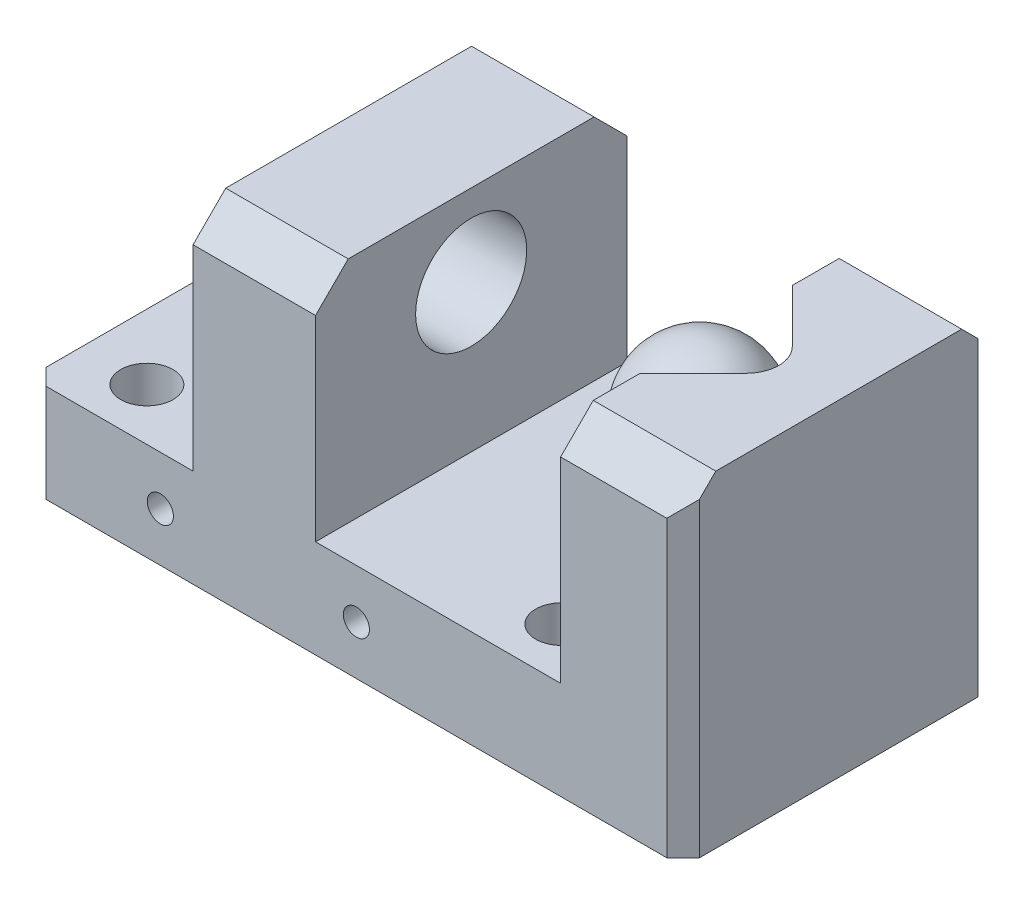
from build123d import *

# Parameters (mm, degrees)
BOSS_EXTRU_1_DEPTH              = 9.525
DIAM_TRE_DU_PER_AGE_3_2_3_2_1_D = 3.2
ENL_V_MAT_EXTRU_1_DEPTH         = 10
ENL_V_MAT_EXTRU_1_DEPTH_BACK    = 5
CHANFREIN1_SIZE                 = 2
CHANFREIN2_SIZE                 = 1
CHANFREIN3_SIZE                 = 1
TROU_TARAUD_M21_AT_2_COUNT      = 2
TROU_TARAUD_M21_AT_2_PITCH      = 12


with BuildPart() as part:
    # Esquisse1 → Boss.-Extru.1 (new, symmetric)
    with BuildSketch(Plane.XY):
        Polygon((0, 6), (0, 0), (40, 0), (40, 20), (32.5, 20), (32.5, 6), (17.5, 6), (17.5, 20), (10, 20), (10, 6), align=None)
    extrude(amount=BOSS_EXTRU_1_DEPTH, both=True)

    # Diam_tre du per_age _3.2 _3.2_1 (through all)
    with Locations(Plane(origin=(0, 0, 0), x_dir=(-1, 0, 0), z_dir=(0, -1, 0))):
        with Locations((-4, 6.35), (-29.4, 6.35), (-4, -6.35), (-29.4, -6.35)):
            Hole(DIAM_TRE_DU_PER_AGE_3_2_3_2_1_D / 2)

    # Esquisse5 → Enl_v. mat.-Extru.1 (cut, two sides: drawn at the far end of the back side and taken through both)
    with BuildSketch(Plane(origin=(0, 15, 0), x_dir=(1, 0, 0), z_dir=(0, 1, 0)).offset(-ENL_V_MAT_EXTRU_1_DEPTH_BACK)):
        with BuildLine():
            Line((32.5, 4.656854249), (32.5, -4.656854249))
            Line((32.5, -4.656854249), (35.742640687, -1.414213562))
            ThreePointArc((35.742640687, -1.414213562), (36.328427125, 0), (35.742640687, 1.414213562))
            Line((35.742640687, 1.414213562), (32.5, 4.656854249))
        make_face()
    extrude(amount=ENL_V_MAT_EXTRU_1_DEPTH + ENL_V_MAT_EXTRU_1_DEPTH_BACK, mode=Mode.SUBTRACT)

    # Esquisse7 → Trou taraud_ M81 (revolve, cut)
    with BuildSketch(Plane(origin=(10, 15, 0), x_dir=(0, 0, 1), z_dir=(0, 1, 0))):
        Polygon((0, 0), (0, 24.292926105), (3.4, 22.25), (3.4, 0), align=None)
    revolve(axis=Axis((3.65, 15, 0), (1, 0, 0)), mode=Mode.SUBTRACT)

    # Chanfrein1
    chanfrein1_edges = [part.edges().sort_by_distance(p)[0] for p in [
        (36.25, 20, 9.525),
        (13.75, 20, -9.525),
        (36.25, 20, -9.525),
        (13.75, 20, 9.525),
    ]]
    chamfer(chanfrein1_edges, length=CHANFREIN1_SIZE)

    # Chanfrein2
    chanfrein2_edges = [part.edges().sort_by_distance(p)[0] for p in [
        (0, 3, 9.525),
        (0, 3, -9.525),
    ]]
    chamfer(chanfrein2_edges, length=CHANFREIN2_SIZE)

    # Chanfrein3
    chanfrein3_edges = [part.edges().sort_by_distance(p)[0] for p in [
        (40, 9, -9.525),
        (40, 9, 9.525),
    ]]
    chamfer(chanfrein3_edges, length=CHANFREIN3_SIZE)

    # Esquisse9 → Trou taraud_ M21 (revolve, cut)
    with BuildSketch(Plane(origin=(8, 3, 9.525), x_dir=(0, -1, 0), z_dir=(1, 0, 0))):
        Polygon((0, 0), (0, 8.480688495), (0.8, 8), (0.8, 0), align=None)
    trou_taraud_m21 = revolve(axis=Axis((8, 3, 15.875), (0, 0, -1)), mode=Mode.SUBTRACT)

    # Trou taraud_ M21 at 2: Trou taraud_ M21 ×2
    with Locations(*[(i * TROU_TARAUD_M21_AT_2_PITCH, 0, 0) for i in range(1, TROU_TARAUD_M21_AT_2_COUNT)]):
        add(trou_taraud_m21, mode=Mode.SUBTRACT)


with BuildPart() as body_2:
    # Esquisse6 → R_volution1 (revolve)
    with BuildSketch(Plane(origin=(0, 15, 0), x_dir=(1, 0, 0), z_dir=(0, 1, 0))):
        with BuildLine():
            Line((27.5, 0), (35.5, 0))
            ThreePointArc((35.5, 0), (31.5, 4), (27.5, 0))
        make_face()
    revolve(axis=Axis((27.5, 15, 0), (1, 0, 0)))


solid = Compound([part.part, body_2.part])
